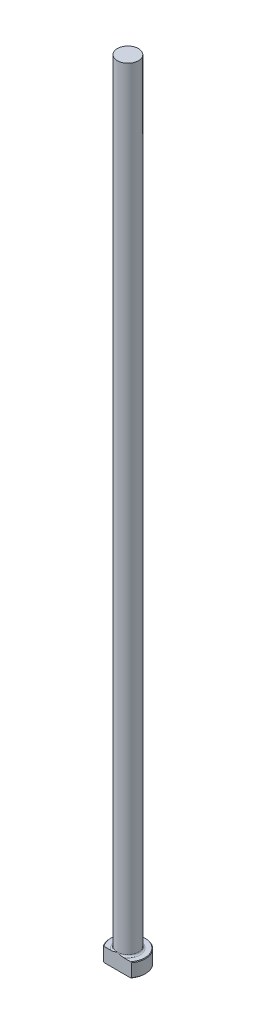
from build123d import *

# Parameters (mm, degrees)
CHAMFER1_SIZE = 0.254
FILLET1_R     = 0.762
KEY_DEPTH     = 356.777132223


with BuildPart() as part:
    # Sketch1 → Revolve1 (revolve)
    with BuildSketch(Plane.XY, mode=Mode.PRIVATE) as revolve1_sk:
        Polygon((0, 0), (-7.9375, 0), (-7.9375, 6.35), (-4.7625, 6.35), (-4.7625, 355.6), (0, 355.6), align=None)
    revolve(revolve1_sk.sketch.rotate(Axis((0, 259.958771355, 0), (0, -1, 0)), 270), axis=Axis((0, 259.958771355, 0), (0, -1, 0)))

    # Chamfer1
    chamfer1_edges = [part.edges().sort_by_distance(p)[0] for p in [
        (0, 6.35, -7.9375),
        (0, 0, -7.9375),
    ]]
    chamfer(chamfer1_edges, length=CHAMFER1_SIZE)

    # Fillet1
    fillet1_edges = [part.edges().sort_by_distance(p)[0] for p in [
        (0, 6.35, -4.7625),
    ]]
    fillet(fillet1_edges, radius=FILLET1_R)

    # Sketch2 → Key (cut, through all)
    with BuildSketch(Plane(origin=(0, 0, 0), x_dir=(1, 0, 0), z_dir=(0, 1, 0))):
        with BuildLine():
            Line((-6.35, -4.7625), (6.35, -4.7625))
            ThreePointArc((6.35, -4.7625), (0, -7.9375), (-6.35, -4.7625))
        make_face()
    extrude(amount=KEY_DEPTH, mode=Mode.SUBTRACT)


solid = part.part
